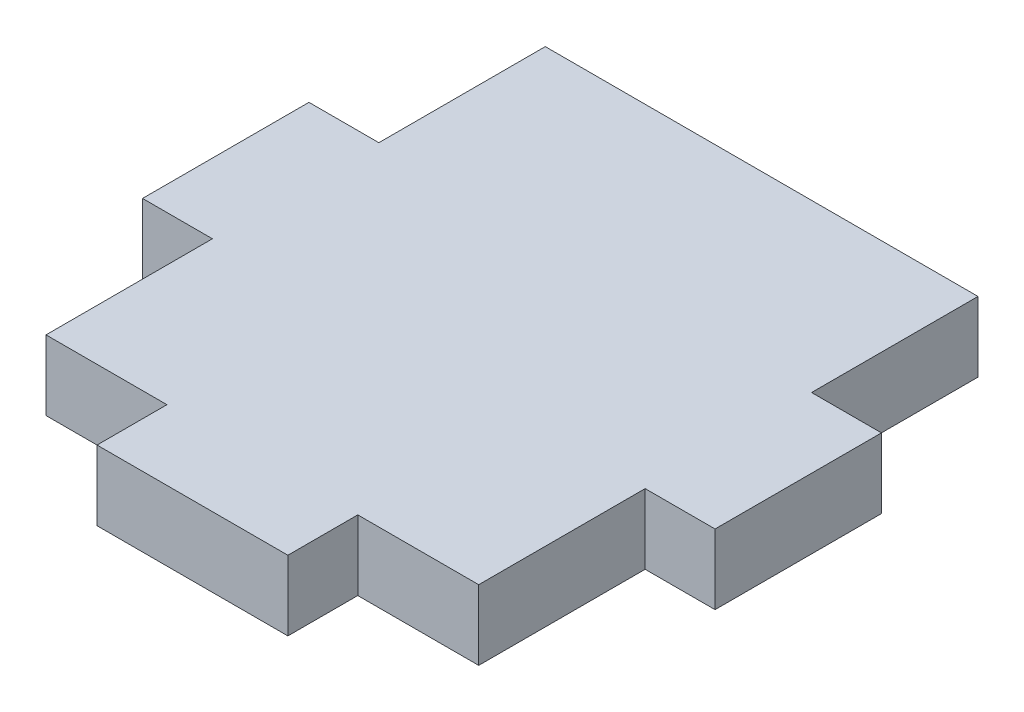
from build123d import *

# Parameters (mm, degrees)
SKETCH1_W           = 33.02
SKETCH1_H           = 38.1
BOSS_EXTRUDE1_DEPTH = 2.667
SKETCH2_W           = 14.562666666
SKETCH2_H           = 5.334
SKETCH2_W_2         = 5.334
SKETCH2_H_2         = 12.7
BOSS_EXTRUDE2_DEPTH = 5.334


with BuildPart() as part:
    # Sketch1 → Boss-Extrude1 (new, symmetric)
    with BuildSketch(Plane(origin=(0, 0, 0), x_dir=(1, 0, 0), z_dir=(0, 1, 0))):
        Rectangle(SKETCH1_W, SKETCH1_H)
    extrude(amount=BOSS_EXTRUDE1_DEPTH, both=True)

    # Sketch2 → Boss-Extrude2 (add)
    with BuildSketch(Plane(origin=(0, 2.667, 0), x_dir=(1, 0, 0), z_dir=(0, 1, 0))):
        with Locations((0, -21.717)):
            Rectangle(SKETCH2_W, SKETCH2_H)
        with Locations((-19.177, 0)):
            Rectangle(SKETCH2_W_2, SKETCH2_H_2)
        with Locations((19.177, 0)):
            Rectangle(SKETCH2_W_2, SKETCH2_H_2)
    extrude(amount=-BOSS_EXTRUDE2_DEPTH)


solid = part.part
